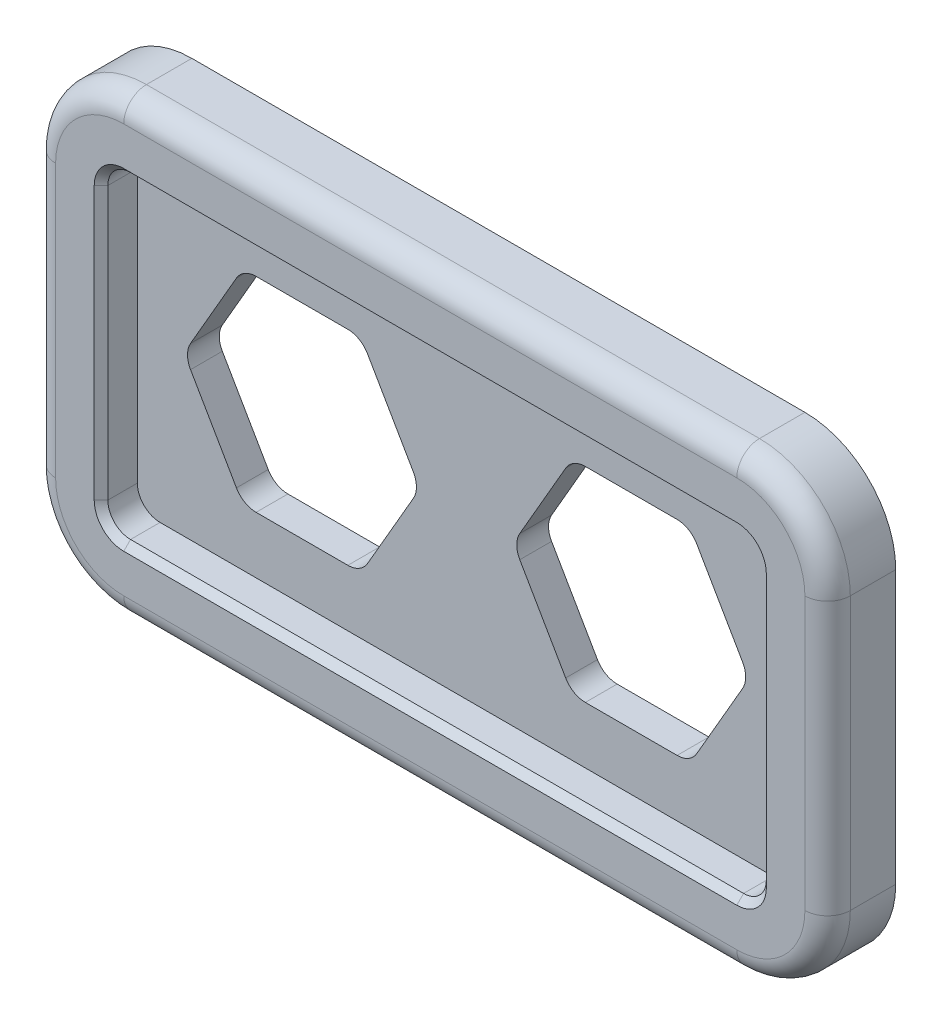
from build123d import *

# Parameters (mm, degrees)
BOSS_EXTRUDE1_DEPTH = 15
CUT_EXTRUDE1_DEPTH  = 8
FILLET1_R           = 5
CHAMFER1_SIZE       = 1.5
CUT_EXTRUDE2_DEPTH  = 102.095252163
FILLET2_R           = 5


with BuildPart() as part:
    # Sketch1 → Boss-Extrude1 (new body)
    with BuildSketch(Plane.XY):
        with BuildLine():
            Line((-67.5, -50), (67.5, -50))
            ThreePointArc((67.5, -50), (81.642135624, -44.142135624), (87.5, -30))
            Line((87.5, -30), (87.5, 30))
            ThreePointArc((87.5, 30), (81.642135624, 44.142135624), (67.5, 50))
            Line((67.5, 50), (-67.5, 50))
            ThreePointArc((-67.5, 50), (-81.642135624, 44.142135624), (-87.5, 30))
            Line((-87.5, 30), (-87.5, -30))
            ThreePointArc((-87.5, -30), (-81.642135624, -44.142135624), (-67.5, -50))
        make_face()
    extrude(amount=-BOSS_EXTRUDE1_DEPTH)

    # Sketch1_3 → Cut-Extrude1 (cut)
    with BuildSketch(Plane.XY):
        with BuildLine():
            Line((-72.5, -30), (-72.5, 30))
            ThreePointArc((-72.5, 30), (-71.035533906, 33.535533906), (-67.5, 35))
            Line((-67.5, 35), (67.5, 35))
            ThreePointArc((67.5, 35), (71.035533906, 33.535533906), (72.5, 30))
            Line((72.5, 30), (72.5, -30))
            ThreePointArc((72.5, -30), (71.035533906, -33.535533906), (67.5, -35))
            Line((67.5, -35), (-67.5, -35))
            ThreePointArc((-67.5, -35), (-71.035533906, -33.535533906), (-72.5, -30))
        make_face()
    extrude(amount=-CUT_EXTRUDE1_DEPTH, mode=Mode.SUBTRACT)

    # Fillet1
    fillet1_edges = [part.edges().sort_by_distance(p)[0] for p in [
        (-87.5, 0, 0),
        (-81.642135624, -44.142135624, 0),
        (0, -50, 0),
        (81.642135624, -44.142135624, 0),
        (87.5, 0, 0),
        (81.642135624, 44.142135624, 0),
        (0, 50, 0),
        (-81.642135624, 44.142135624, 0),
    ]]
    fillet(fillet1_edges, radius=FILLET1_R)

    # Chamfer1
    chamfer1_edges = [part.edges().sort_by_distance(p)[0] for p in [
        (-71.035533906, -33.535533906, 0),
        (-72.5, 0, 0),
        (-71.035533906, 33.535533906, 0),
        (0, 35, 0),
        (71.035533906, 33.535533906, 0),
        (0, -35, 0),
        (71.035533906, -33.535533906, 0),
        (72.5, 0, 0),
    ]]
    chamfer(chamfer1_edges, length=CHAMFER1_SIZE)

    # Sketch3 → Cut-Extrude2 (cut, through all)
    with BuildSketch(Plane.XY.offset(-8)):
        Polygon((-10.269237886, 0), (-23.259618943, 22.5), (-49.240381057, 22.5), (-62.230762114, 0), (-49.240381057, -22.5), (-23.259618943, -22.5), align=None)
        Polygon((23.259618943, -22.5), (10.269237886, 0), (23.259618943, 22.5), (49.240381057, 22.5), (62.230762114, 0), (49.240381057, -22.5), align=None)
    extrude(amount=-CUT_EXTRUDE2_DEPTH, mode=Mode.SUBTRACT)

    # Fillet2
    fillet2_edges = [part.edges().sort_by_distance(p)[0] for p in [
        (-10.269237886, 0, -11.5),
        (-23.259618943, -22.5, -11.5),
        (-49.240381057, -22.5, -11.5),
        (-62.230762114, 0, -11.5),
        (-49.240381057, 22.5, -11.5),
        (-23.259618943, 22.5, -11.5),
        (49.240381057, -22.5, -11.5),
        (23.259618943, -22.5, -11.5),
        (10.269237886, 0, -11.5),
        (23.259618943, 22.5, -11.5),
        (49.240381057, 22.5, -11.5),
        (62.230762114, 0, -11.5),
    ]]
    fillet(fillet2_edges, radius=FILLET2_R)


solid = part.part
